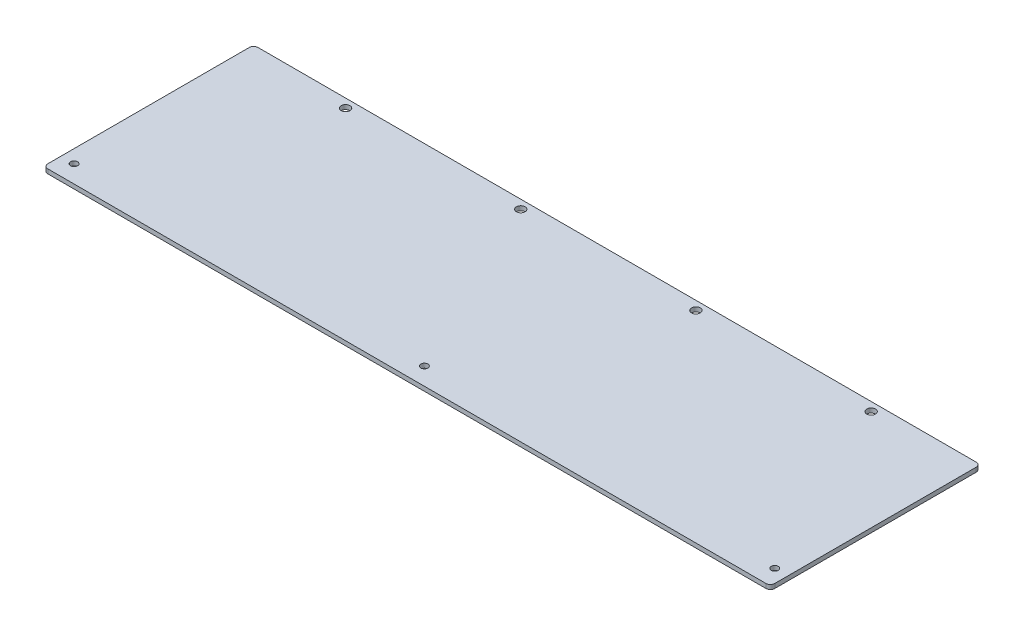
ISO-10303-21;
HEADER;
FILE_DESCRIPTION(('STEP AP214'),'2;1');
FILE_NAME('part.step','',(''),(''),'','','');
FILE_SCHEMA(('AUTOMOTIVE_DESIGN { 1 0 10303 214 1 1 1 1 }'));
ENDSEC;
DATA;
#1=APPLICATION_CONTEXT('core data for automotive mechanical design processes');
#2=APPLICATION_PROTOCOL_DEFINITION('international standard','automotive_design',2000,#1);
#3=PRODUCT_CONTEXT('',#1,'mechanical');
#4=PRODUCT('Part','Part','',(#3));
#5=PRODUCT_RELATED_PRODUCT_CATEGORY('part','',(#4));
#6=PRODUCT_DEFINITION_FORMATION('','',#4);
#7=PRODUCT_DEFINITION_CONTEXT('part definition',#1,'design');
#8=PRODUCT_DEFINITION('design','',#6,#7);
#9=PRODUCT_DEFINITION_SHAPE('','',#8);
#10=(LENGTH_UNIT() NAMED_UNIT(*) SI_UNIT(.MILLI.,.METRE.));
#11=(NAMED_UNIT(*) PLANE_ANGLE_UNIT() SI_UNIT($,.RADIAN.));
#12=(NAMED_UNIT(*) SI_UNIT($,.STERADIAN.) SOLID_ANGLE_UNIT());
#13=UNCERTAINTY_MEASURE_WITH_UNIT(LENGTH_MEASURE(1.E-05),#10,'distance_accuracy_value','');
#14=(GEOMETRIC_REPRESENTATION_CONTEXT(3) GLOBAL_UNCERTAINTY_ASSIGNED_CONTEXT((#13)) GLOBAL_UNIT_ASSIGNED_CONTEXT((#10,
#11,#12)) REPRESENTATION_CONTEXT('',''));
#15=CARTESIAN_POINT('',(0.,0.,0.));
#16=DIRECTION('',(0.,0.,1.));
#17=DIRECTION('',(1.,0.,0.));
#18=AXIS2_PLACEMENT_3D('',#15,#16,#17);
#19=CARTESIAN_POINT('',(263.525,3.175,-76.2));
#20=DIRECTION('',(-1.,0.,0.));
#21=DIRECTION('',(0.,0.,1.));
#22=AXIS2_PLACEMENT_3D('',#19,#20,#21);
#23=PLANE('',#22);
#24=DIRECTION('',(0.,0.,-1.));
#25=VECTOR('',#24,1.);
#26=CARTESIAN_POINT('',(263.525,3.175,-76.2));
#27=LINE('',#26,#25);
#28=CARTESIAN_POINT('',(263.525,3.175,73.025));
#29=VERTEX_POINT('',#28);
#30=CARTESIAN_POINT('',(263.525,3.175,-73.025));
#31=VERTEX_POINT('',#30);
#32=EDGE_CURVE('E134',#29,#31,#27,.T.);
#33=ORIENTED_EDGE('',*,*,#32,.F.);
#34=DIRECTION('',(0.,-1.,0.));
#35=VECTOR('',#34,1.);
#36=CARTESIAN_POINT('',(263.525,3.175,73.025));
#37=LINE('',#36,#35);
#38=CARTESIAN_POINT('',(263.525,0.,73.025));
#39=VERTEX_POINT('',#38);
#40=EDGE_CURVE('E11',#29,#39,#37,.T.);
#41=ORIENTED_EDGE('',*,*,#40,.T.);
#42=DIRECTION('',(0.,0.,-1.));
#43=VECTOR('',#42,1.);
#44=CARTESIAN_POINT('',(263.525,0.,-76.2));
#45=LINE('',#44,#43);
#46=CARTESIAN_POINT('',(263.525,0.,-73.025));
#47=VERTEX_POINT('',#46);
#48=EDGE_CURVE('E182',#39,#47,#45,.T.);
#49=ORIENTED_EDGE('',*,*,#48,.T.);
#50=DIRECTION('',(0.,-1.,0.));
#51=VECTOR('',#50,1.);
#52=CARTESIAN_POINT('',(263.525,3.175,-73.025));
#53=LINE('',#52,#51);
#54=EDGE_CURVE('E45',#47,#31,#53,.F.);
#55=ORIENTED_EDGE('',*,*,#54,.T.);
#56=EDGE_LOOP('',(#33,#41,#49,#55));
#57=FACE_BOUND('',#56,.T.);
#58=ADVANCED_FACE('F36',(#57),#23,.F.);
#59=CARTESIAN_POINT('',(-263.525,3.175,-76.2));
#60=DIRECTION('',(0.,0.,1.));
#61=DIRECTION('',(1.,0.,0.));
#62=AXIS2_PLACEMENT_3D('',#59,#60,#61);
#63=PLANE('',#62);
#64=DIRECTION('',(-1.,0.,0.));
#65=VECTOR('',#64,1.);
#66=CARTESIAN_POINT('',(-263.525,0.,-76.2));
#67=LINE('',#66,#65);
#68=CARTESIAN_POINT('',(260.35,0.,-76.2));
#69=VERTEX_POINT('',#68);
#70=CARTESIAN_POINT('',(-260.35,0.,-76.2));
#71=VERTEX_POINT('',#70);
#72=EDGE_CURVE('E142',#69,#71,#67,.T.);
#73=ORIENTED_EDGE('',*,*,#72,.T.);
#74=DIRECTION('',(0.,-1.,0.));
#75=VECTOR('',#74,1.);
#76=CARTESIAN_POINT('',(-260.35,3.175,-76.2));
#77=LINE('',#76,#75);
#78=CARTESIAN_POINT('',(-260.35,3.175,-76.2));
#79=VERTEX_POINT('',#78);
#80=EDGE_CURVE('E52',#71,#79,#77,.F.);
#81=ORIENTED_EDGE('',*,*,#80,.T.);
#82=DIRECTION('',(-1.,0.,0.));
#83=VECTOR('',#82,1.);
#84=CARTESIAN_POINT('',(-263.525,3.175,-76.2));
#85=LINE('',#84,#83);
#86=CARTESIAN_POINT('',(260.35,3.175,-76.2));
#87=VERTEX_POINT('',#86);
#88=EDGE_CURVE('E140',#87,#79,#85,.T.);
#89=ORIENTED_EDGE('',*,*,#88,.F.);
#90=DIRECTION('',(0.,-1.,0.));
#91=VECTOR('',#90,1.);
#92=CARTESIAN_POINT('',(260.35,3.175,-76.2));
#93=LINE('',#92,#91);
#94=EDGE_CURVE('E170',#87,#69,#93,.T.);
#95=ORIENTED_EDGE('',*,*,#94,.T.);
#96=EDGE_LOOP('',(#73,#81,#89,#95));
#97=FACE_BOUND('',#96,.T.);
#98=ADVANCED_FACE('F189',(#97),#63,.F.);
#99=CARTESIAN_POINT('',(-263.525,3.175,-76.2));
#100=DIRECTION('',(1.,0.,0.));
#101=DIRECTION('',(0.,0.,-1.));
#102=AXIS2_PLACEMENT_3D('',#99,#100,#101);
#103=PLANE('',#102);
#104=DIRECTION('',(0.,0.,1.));
#105=VECTOR('',#104,1.);
#106=CARTESIAN_POINT('',(-263.525,0.,-76.2));
#107=LINE('',#106,#105);
#108=CARTESIAN_POINT('',(-263.525,0.,-73.025));
#109=VERTEX_POINT('',#108);
#110=CARTESIAN_POINT('',(-263.525,0.,73.025));
#111=VERTEX_POINT('',#110);
#112=EDGE_CURVE('E135',#109,#111,#107,.T.);
#113=ORIENTED_EDGE('',*,*,#112,.T.);
#114=DIRECTION('',(0.,-1.,0.));
#115=VECTOR('',#114,1.);
#116=CARTESIAN_POINT('',(-263.525,3.175,73.025));
#117=LINE('',#116,#115);
#118=CARTESIAN_POINT('',(-263.525,3.175,73.025));
#119=VERTEX_POINT('',#118);
#120=EDGE_CURVE('E109',#111,#119,#117,.F.);
#121=ORIENTED_EDGE('',*,*,#120,.T.);
#122=DIRECTION('',(0.,0.,1.));
#123=VECTOR('',#122,1.);
#124=CARTESIAN_POINT('',(-263.525,3.175,-76.2));
#125=LINE('',#124,#123);
#126=CARTESIAN_POINT('',(-263.525,3.175,-73.025));
#127=VERTEX_POINT('',#126);
#128=EDGE_CURVE('E198',#127,#119,#125,.T.);
#129=ORIENTED_EDGE('',*,*,#128,.F.);
#130=DIRECTION('',(0.,-1.,0.));
#131=VECTOR('',#130,1.);
#132=CARTESIAN_POINT('',(-263.525,3.175,-73.025));
#133=LINE('',#132,#131);
#134=EDGE_CURVE('E115',#127,#109,#133,.T.);
#135=ORIENTED_EDGE('',*,*,#134,.T.);
#136=EDGE_LOOP('',(#113,#121,#129,#135));
#137=FACE_BOUND('',#136,.T.);
#138=ADVANCED_FACE('F296',(#137),#103,.F.);
#139=CARTESIAN_POINT('',(-263.525,3.175,76.2));
#140=DIRECTION('',(0.,0.,-1.));
#141=DIRECTION('',(-1.,0.,0.));
#142=AXIS2_PLACEMENT_3D('',#139,#140,#141);
#143=PLANE('',#142);
#144=DIRECTION('',(1.,0.,0.));
#145=VECTOR('',#144,1.);
#146=CARTESIAN_POINT('',(-263.525,3.175,76.2));
#147=LINE('',#146,#145);
#148=CARTESIAN_POINT('',(-260.35,3.175,76.2));
#149=VERTEX_POINT('',#148);
#150=CARTESIAN_POINT('',(260.35,3.175,76.2));
#151=VERTEX_POINT('',#150);
#152=EDGE_CURVE('E125',#149,#151,#147,.T.);
#153=ORIENTED_EDGE('',*,*,#152,.F.);
#154=DIRECTION('',(0.,-1.,0.));
#155=VECTOR('',#154,1.);
#156=CARTESIAN_POINT('',(-260.35,3.175,76.2));
#157=LINE('',#156,#155);
#158=CARTESIAN_POINT('',(-260.35,0.,76.2));
#159=VERTEX_POINT('',#158);
#160=EDGE_CURVE('E108',#149,#159,#157,.T.);
#161=ORIENTED_EDGE('',*,*,#160,.T.);
#162=DIRECTION('',(1.,0.,0.));
#163=VECTOR('',#162,1.);
#164=CARTESIAN_POINT('',(-263.525,0.,76.2));
#165=LINE('',#164,#163);
#166=CARTESIAN_POINT('',(260.35,0.,76.2));
#167=VERTEX_POINT('',#166);
#168=EDGE_CURVE('E122',#159,#167,#165,.T.);
#169=ORIENTED_EDGE('',*,*,#168,.T.);
#170=DIRECTION('',(0.,-1.,0.));
#171=VECTOR('',#170,1.);
#172=CARTESIAN_POINT('',(260.35,3.175,76.2));
#173=LINE('',#172,#171);
#174=EDGE_CURVE('E128',#167,#151,#173,.F.);
#175=ORIENTED_EDGE('',*,*,#174,.T.);
#176=EDGE_LOOP('',(#153,#161,#169,#175));
#177=FACE_BOUND('',#176,.T.);
#178=ADVANCED_FACE('F121',(#177),#143,.F.);
#179=CARTESIAN_POINT('',(0.,3.175,0.));
#180=DIRECTION('',(0.,1.,0.));
#181=DIRECTION('',(0.,0.,1.));
#182=AXIS2_PLACEMENT_3D('',#179,#180,#181);
#183=PLANE('',#182);
#184=CARTESIAN_POINT('',(190.5,3.175,-69.85));
#185=DIRECTION('',(0.,1.,0.));
#186=DIRECTION('',(0.,0.,1.));
#187=AXIS2_PLACEMENT_3D('',#184,#185,#186);
#188=CIRCLE('',#187,3.17500000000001);
#189=CARTESIAN_POINT('',(190.5,3.175,-66.675));
#190=VERTEX_POINT('',#189);
#191=EDGE_CURVE('E254',#190,#190,#188,.T.);
#192=ORIENTED_EDGE('',*,*,#191,.F.);
#193=EDGE_LOOP('',(#192));
#194=FACE_BOUND('',#193,.T.);
#195=CARTESIAN_POINT('',(63.5,3.175,-69.85));
#196=DIRECTION('',(0.,1.,0.));
#197=DIRECTION('',(0.,0.,1.));
#198=AXIS2_PLACEMENT_3D('',#195,#196,#197);
#199=CIRCLE('',#198,3.175);
#200=CARTESIAN_POINT('',(63.5,3.175,-66.675));
#201=VERTEX_POINT('',#200);
#202=EDGE_CURVE('E246',#201,#201,#199,.T.);
#203=ORIENTED_EDGE('',*,*,#202,.F.);
#204=EDGE_LOOP('',(#203));
#205=FACE_BOUND('',#204,.T.);
#206=CARTESIAN_POINT('',(-63.5,3.175,-69.85));
#207=DIRECTION('',(0.,1.,0.));
#208=DIRECTION('',(0.,0.,1.));
#209=AXIS2_PLACEMENT_3D('',#206,#207,#208);
#210=CIRCLE('',#209,3.175);
#211=CARTESIAN_POINT('',(-63.5,3.175,-66.675));
#212=VERTEX_POINT('',#211);
#213=EDGE_CURVE('E238',#212,#212,#210,.T.);
#214=ORIENTED_EDGE('',*,*,#213,.F.);
#215=EDGE_LOOP('',(#214));
#216=FACE_BOUND('',#215,.T.);
#217=CARTESIAN_POINT('',(-190.5,3.175,-69.85));
#218=DIRECTION('',(0.,1.,0.));
#219=DIRECTION('',(0.,0.,1.));
#220=AXIS2_PLACEMENT_3D('',#217,#218,#219);
#221=CIRCLE('',#220,3.17500000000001);
#222=CARTESIAN_POINT('',(-190.5,3.175,-66.675));
#223=VERTEX_POINT('',#222);
#224=EDGE_CURVE('E230',#223,#223,#221,.T.);
#225=ORIENTED_EDGE('',*,*,#224,.F.);
#226=EDGE_LOOP('',(#225));
#227=FACE_BOUND('',#226,.T.);
#228=CARTESIAN_POINT('',(254.,3.175,63.5));
#229=DIRECTION('',(0.,-1.,0.));
#230=DIRECTION('',(0.,0.,-1.));
#231=AXIS2_PLACEMENT_3D('',#228,#229,#230);
#232=CIRCLE('',#231,2.55270000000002);
#233=CARTESIAN_POINT('',(254.,3.175,60.9473));
#234=VERTEX_POINT('',#233);
#235=EDGE_CURVE('E218',#234,#234,#232,.T.);
#236=ORIENTED_EDGE('',*,*,#235,.T.);
#237=EDGE_LOOP('',(#236));
#238=FACE_BOUND('',#237,.T.);
#239=CARTESIAN_POINT('',(0.,3.175,63.5));
#240=DIRECTION('',(0.,-1.,0.));
#241=DIRECTION('',(0.,0.,-1.));
#242=AXIS2_PLACEMENT_3D('',#239,#240,#241);
#243=CIRCLE('',#242,2.5527);
#244=CARTESIAN_POINT('',(0.,3.175,60.9473));
#245=VERTEX_POINT('',#244);
#246=EDGE_CURVE('E210',#245,#245,#243,.T.);
#247=ORIENTED_EDGE('',*,*,#246,.T.);
#248=EDGE_LOOP('',(#247));
#249=FACE_BOUND('',#248,.T.);
#250=CARTESIAN_POINT('',(-254.,3.175,63.5));
#251=DIRECTION('',(0.,-1.,0.));
#252=DIRECTION('',(0.,0.,-1.));
#253=AXIS2_PLACEMENT_3D('',#250,#251,#252);
#254=CIRCLE('',#253,2.55270000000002);
#255=CARTESIAN_POINT('',(-254.,3.175,60.9473));
#256=VERTEX_POINT('',#255);
#257=EDGE_CURVE('E193',#256,#256,#254,.T.);
#258=ORIENTED_EDGE('',*,*,#257,.T.);
#259=EDGE_LOOP('',(#258));
#260=FACE_BOUND('',#259,.T.);
#261=ORIENTED_EDGE('',*,*,#128,.T.);
#262=CARTESIAN_POINT('',(-260.35,3.175,73.025));
#263=DIRECTION('',(0.,1.,0.));
#264=DIRECTION('',(0.,0.,1.));
#265=AXIS2_PLACEMENT_3D('',#262,#263,#264);
#266=CIRCLE('',#265,3.175);
#267=EDGE_CURVE('E167',#119,#149,#266,.T.);
#268=ORIENTED_EDGE('',*,*,#267,.T.);
#269=ORIENTED_EDGE('',*,*,#152,.T.);
#270=CARTESIAN_POINT('',(260.35,3.175,73.025));
#271=DIRECTION('',(0.,1.,0.));
#272=DIRECTION('',(0.,0.,1.));
#273=AXIS2_PLACEMENT_3D('',#270,#271,#272);
#274=CIRCLE('',#273,3.175);
#275=EDGE_CURVE('E161',#151,#29,#274,.T.);
#276=ORIENTED_EDGE('',*,*,#275,.T.);
#277=ORIENTED_EDGE('',*,*,#32,.T.);
#278=CARTESIAN_POINT('',(260.35,3.175,-73.025));
#279=DIRECTION('',(0.,1.,0.));
#280=DIRECTION('',(0.,0.,1.));
#281=AXIS2_PLACEMENT_3D('',#278,#279,#280);
#282=CIRCLE('',#281,3.175);
#283=EDGE_CURVE('E59',#31,#87,#282,.T.);
#284=ORIENTED_EDGE('',*,*,#283,.T.);
#285=ORIENTED_EDGE('',*,*,#88,.T.);
#286=CARTESIAN_POINT('',(-260.35,3.175,-73.025));
#287=DIRECTION('',(0.,1.,0.));
#288=DIRECTION('',(0.,0.,1.));
#289=AXIS2_PLACEMENT_3D('',#286,#287,#288);
#290=CIRCLE('',#289,3.175);
#291=EDGE_CURVE('E164',#79,#127,#290,.T.);
#292=ORIENTED_EDGE('',*,*,#291,.T.);
#293=EDGE_LOOP('',(#261,#268,#269,#276,#277,#284,#285,#292));
#294=FACE_BOUND('',#293,.T.);
#295=ADVANCED_FACE('F185',(#194,#205,#216,#227,#238,#249,#260,#294),#183,.T.);
#296=CARTESIAN_POINT('',(0.,0.,0.));
#297=DIRECTION('',(0.,1.,0.));
#298=DIRECTION('',(0.,0.,1.));
#299=AXIS2_PLACEMENT_3D('',#296,#297,#298);
#300=PLANE('',#299);
#301=CARTESIAN_POINT('',(190.5,0.,-69.85));
#302=DIRECTION('',(0.,1.,0.));
#303=DIRECTION('',(0.,0.,1.));
#304=AXIS2_PLACEMENT_3D('',#301,#302,#303);
#305=CIRCLE('',#304,3.17500000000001);
#306=CARTESIAN_POINT('',(190.5,0.,-66.675));
#307=VERTEX_POINT('',#306);
#308=EDGE_CURVE('E250',#307,#307,#305,.T.);
#309=ORIENTED_EDGE('',*,*,#308,.T.);
#310=EDGE_LOOP('',(#309));
#311=FACE_BOUND('',#310,.T.);
#312=CARTESIAN_POINT('',(63.5,0.,-69.85));
#313=DIRECTION('',(0.,1.,0.));
#314=DIRECTION('',(0.,0.,1.));
#315=AXIS2_PLACEMENT_3D('',#312,#313,#314);
#316=CIRCLE('',#315,3.175);
#317=CARTESIAN_POINT('',(63.5,0.,-66.675));
#318=VERTEX_POINT('',#317);
#319=EDGE_CURVE('E242',#318,#318,#316,.T.);
#320=ORIENTED_EDGE('',*,*,#319,.T.);
#321=EDGE_LOOP('',(#320));
#322=FACE_BOUND('',#321,.T.);
#323=CARTESIAN_POINT('',(-63.5,0.,-69.85));
#324=DIRECTION('',(0.,1.,0.));
#325=DIRECTION('',(0.,0.,1.));
#326=AXIS2_PLACEMENT_3D('',#323,#324,#325);
#327=CIRCLE('',#326,3.175);
#328=CARTESIAN_POINT('',(-63.5,0.,-66.675));
#329=VERTEX_POINT('',#328);
#330=EDGE_CURVE('E234',#329,#329,#327,.T.);
#331=ORIENTED_EDGE('',*,*,#330,.T.);
#332=EDGE_LOOP('',(#331));
#333=FACE_BOUND('',#332,.T.);
#334=CARTESIAN_POINT('',(-190.5,0.,-69.85));
#335=DIRECTION('',(0.,1.,0.));
#336=DIRECTION('',(0.,0.,1.));
#337=AXIS2_PLACEMENT_3D('',#334,#335,#336);
#338=CIRCLE('',#337,3.17500000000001);
#339=CARTESIAN_POINT('',(-190.5,0.,-66.675));
#340=VERTEX_POINT('',#339);
#341=EDGE_CURVE('E226',#340,#340,#338,.T.);
#342=ORIENTED_EDGE('',*,*,#341,.T.);
#343=EDGE_LOOP('',(#342));
#344=FACE_BOUND('',#343,.T.);
#345=CARTESIAN_POINT('',(254.,0.,63.5));
#346=DIRECTION('',(0.,-1.,0.));
#347=DIRECTION('',(0.,0.,-1.));
#348=AXIS2_PLACEMENT_3D('',#345,#346,#347);
#349=CIRCLE('',#348,2.55269999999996);
#350=CARTESIAN_POINT('',(254.,0.,60.9473));
#351=VERTEX_POINT('',#350);
#352=EDGE_CURVE('E222',#351,#351,#349,.T.);
#353=ORIENTED_EDGE('',*,*,#352,.F.);
#354=EDGE_LOOP('',(#353));
#355=FACE_BOUND('',#354,.T.);
#356=CARTESIAN_POINT('',(0.,0.,63.5));
#357=DIRECTION('',(0.,-1.,0.));
#358=DIRECTION('',(0.,0.,-1.));
#359=AXIS2_PLACEMENT_3D('',#356,#357,#358);
#360=CIRCLE('',#359,2.55269999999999);
#361=CARTESIAN_POINT('',(0.,0.,60.9473));
#362=VERTEX_POINT('',#361);
#363=EDGE_CURVE('E214',#362,#362,#360,.T.);
#364=ORIENTED_EDGE('',*,*,#363,.F.);
#365=EDGE_LOOP('',(#364));
#366=FACE_BOUND('',#365,.T.);
#367=CARTESIAN_POINT('',(-254.,0.,63.5));
#368=DIRECTION('',(0.,-1.,0.));
#369=DIRECTION('',(0.,0.,-1.));
#370=AXIS2_PLACEMENT_3D('',#367,#368,#369);
#371=CIRCLE('',#370,2.55269999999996);
#372=CARTESIAN_POINT('',(-254.,0.,60.9473));
#373=VERTEX_POINT('',#372);
#374=EDGE_CURVE('E206',#373,#373,#371,.T.);
#375=ORIENTED_EDGE('',*,*,#374,.F.);
#376=EDGE_LOOP('',(#375));
#377=FACE_BOUND('',#376,.T.);
#378=ORIENTED_EDGE('',*,*,#168,.F.);
#379=CARTESIAN_POINT('',(-260.35,0.,73.025));
#380=DIRECTION('',(0.,1.,0.));
#381=DIRECTION('',(0.,0.,1.));
#382=AXIS2_PLACEMENT_3D('',#379,#380,#381);
#383=CIRCLE('',#382,3.175);
#384=EDGE_CURVE('E104',#159,#111,#383,.F.);
#385=ORIENTED_EDGE('',*,*,#384,.T.);
#386=ORIENTED_EDGE('',*,*,#112,.F.);
#387=CARTESIAN_POINT('',(-260.35,0.,-73.025));
#388=DIRECTION('',(0.,1.,0.));
#389=DIRECTION('',(0.,0.,1.));
#390=AXIS2_PLACEMENT_3D('',#387,#388,#389);
#391=CIRCLE('',#390,3.175);
#392=EDGE_CURVE('E116',#109,#71,#391,.F.);
#393=ORIENTED_EDGE('',*,*,#392,.T.);
#394=ORIENTED_EDGE('',*,*,#72,.F.);
#395=CARTESIAN_POINT('',(260.35,0.,-73.025));
#396=DIRECTION('',(0.,1.,0.));
#397=DIRECTION('',(0.,0.,1.));
#398=AXIS2_PLACEMENT_3D('',#395,#396,#397);
#399=CIRCLE('',#398,3.175);
#400=EDGE_CURVE('E127',#69,#47,#399,.F.);
#401=ORIENTED_EDGE('',*,*,#400,.T.);
#402=ORIENTED_EDGE('',*,*,#48,.F.);
#403=CARTESIAN_POINT('',(260.35,0.,73.025));
#404=DIRECTION('',(0.,1.,0.));
#405=DIRECTION('',(0.,0.,1.));
#406=AXIS2_PLACEMENT_3D('',#403,#404,#405);
#407=CIRCLE('',#406,3.175);
#408=EDGE_CURVE('E132',#39,#167,#407,.F.);
#409=ORIENTED_EDGE('',*,*,#408,.T.);
#410=EDGE_LOOP('',(#378,#385,#386,#393,#394,#401,#402,#409));
#411=FACE_BOUND('',#410,.T.);
#412=ADVANCED_FACE('F130',(#311,#322,#333,#344,#355,#366,#377,#411),#300,.F.);
#413=CARTESIAN_POINT('',(-254.,0.,63.5));
#414=DIRECTION('',(0.,-1.,0.));
#415=DIRECTION('',(0.,0.,-1.));
#416=AXIS2_PLACEMENT_3D('',#413,#414,#415);
#417=CYLINDRICAL_SURFACE('',#416,2.55269999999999);
#418=ORIENTED_EDGE('',*,*,#257,.F.);
#419=EDGE_LOOP('',(#418));
#420=FACE_BOUND('',#419,.T.);
#421=ORIENTED_EDGE('',*,*,#374,.T.);
#422=EDGE_LOOP('',(#421));
#423=FACE_BOUND('',#422,.T.);
#424=ADVANCED_FACE('F277',(#420,#423),#417,.F.);
#425=CARTESIAN_POINT('',(0.,0.,63.5));
#426=DIRECTION('',(0.,-1.,0.));
#427=DIRECTION('',(0.,0.,-1.));
#428=AXIS2_PLACEMENT_3D('',#425,#426,#427);
#429=CYLINDRICAL_SURFACE('',#428,2.55269999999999);
#430=ORIENTED_EDGE('',*,*,#246,.F.);
#431=EDGE_LOOP('',(#430));
#432=FACE_BOUND('',#431,.T.);
#433=ORIENTED_EDGE('',*,*,#363,.T.);
#434=EDGE_LOOP('',(#433));
#435=FACE_BOUND('',#434,.T.);
#436=ADVANCED_FACE('F280',(#432,#435),#429,.F.);
#437=CARTESIAN_POINT('',(254.,0.,63.5));
#438=DIRECTION('',(0.,-1.,0.));
#439=DIRECTION('',(0.,0.,-1.));
#440=AXIS2_PLACEMENT_3D('',#437,#438,#439);
#441=CYLINDRICAL_SURFACE('',#440,2.55269999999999);
#442=ORIENTED_EDGE('',*,*,#235,.F.);
#443=EDGE_LOOP('',(#442));
#444=FACE_BOUND('',#443,.T.);
#445=ORIENTED_EDGE('',*,*,#352,.T.);
#446=EDGE_LOOP('',(#445));
#447=FACE_BOUND('',#446,.T.);
#448=ADVANCED_FACE('F303',(#444,#447),#441,.F.);
#449=CARTESIAN_POINT('',(-260.35,3.175,73.025));
#450=DIRECTION('',(0.,-1.,0.));
#451=DIRECTION('',(0.,0.,-1.));
#452=AXIS2_PLACEMENT_3D('',#449,#450,#451);
#453=CYLINDRICAL_SURFACE('',#452,3.175);
#454=ORIENTED_EDGE('',*,*,#267,.F.);
#455=ORIENTED_EDGE('',*,*,#120,.F.);
#456=ORIENTED_EDGE('',*,*,#384,.F.);
#457=ORIENTED_EDGE('',*,*,#160,.F.);
#458=EDGE_LOOP('',(#454,#455,#456,#457));
#459=FACE_BOUND('',#458,.T.);
#460=ADVANCED_FACE('F107',(#459),#453,.T.);
#461=CARTESIAN_POINT('',(-260.35,3.175,-73.025));
#462=DIRECTION('',(0.,-1.,0.));
#463=DIRECTION('',(0.,0.,-1.));
#464=AXIS2_PLACEMENT_3D('',#461,#462,#463);
#465=CYLINDRICAL_SURFACE('',#464,3.175);
#466=ORIENTED_EDGE('',*,*,#291,.F.);
#467=ORIENTED_EDGE('',*,*,#80,.F.);
#468=ORIENTED_EDGE('',*,*,#392,.F.);
#469=ORIENTED_EDGE('',*,*,#134,.F.);
#470=EDGE_LOOP('',(#466,#467,#468,#469));
#471=FACE_BOUND('',#470,.T.);
#472=ADVANCED_FACE('F302',(#471),#465,.T.);
#473=CARTESIAN_POINT('',(260.35,3.175,73.025));
#474=DIRECTION('',(0.,-1.,0.));
#475=DIRECTION('',(0.,0.,-1.));
#476=AXIS2_PLACEMENT_3D('',#473,#474,#475);
#477=CYLINDRICAL_SURFACE('',#476,3.175);
#478=ORIENTED_EDGE('',*,*,#275,.F.);
#479=ORIENTED_EDGE('',*,*,#174,.F.);
#480=ORIENTED_EDGE('',*,*,#408,.F.);
#481=ORIENTED_EDGE('',*,*,#40,.F.);
#482=EDGE_LOOP('',(#478,#479,#480,#481));
#483=FACE_BOUND('',#482,.T.);
#484=ADVANCED_FACE('F305',(#483),#477,.T.);
#485=CARTESIAN_POINT('',(260.35,3.175,-73.025));
#486=DIRECTION('',(0.,-1.,0.));
#487=DIRECTION('',(0.,0.,-1.));
#488=AXIS2_PLACEMENT_3D('',#485,#486,#487);
#489=CYLINDRICAL_SURFACE('',#488,3.175);
#490=ORIENTED_EDGE('',*,*,#283,.F.);
#491=ORIENTED_EDGE('',*,*,#54,.F.);
#492=ORIENTED_EDGE('',*,*,#400,.F.);
#493=ORIENTED_EDGE('',*,*,#94,.F.);
#494=EDGE_LOOP('',(#490,#491,#492,#493));
#495=FACE_BOUND('',#494,.T.);
#496=ADVANCED_FACE('F38',(#495),#489,.T.);
#497=CARTESIAN_POINT('',(-190.5,3.175,-69.85));
#498=DIRECTION('',(0.,1.,0.));
#499=DIRECTION('',(0.,0.,1.));
#500=AXIS2_PLACEMENT_3D('',#497,#498,#499);
#501=CYLINDRICAL_SURFACE('',#500,3.17500000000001);
#502=ORIENTED_EDGE('',*,*,#341,.F.);
#503=EDGE_LOOP('',(#502));
#504=FACE_BOUND('',#503,.T.);
#505=ORIENTED_EDGE('',*,*,#224,.T.);
#506=EDGE_LOOP('',(#505));
#507=FACE_BOUND('',#506,.T.);
#508=ADVANCED_FACE('F312',(#504,#507),#501,.F.);
#509=CARTESIAN_POINT('',(-63.5,3.175,-69.85));
#510=DIRECTION('',(0.,1.,0.));
#511=DIRECTION('',(0.,0.,1.));
#512=AXIS2_PLACEMENT_3D('',#509,#510,#511);
#513=CYLINDRICAL_SURFACE('',#512,3.175);
#514=ORIENTED_EDGE('',*,*,#330,.F.);
#515=EDGE_LOOP('',(#514));
#516=FACE_BOUND('',#515,.T.);
#517=ORIENTED_EDGE('',*,*,#213,.T.);
#518=EDGE_LOOP('',(#517));
#519=FACE_BOUND('',#518,.T.);
#520=ADVANCED_FACE('F387',(#516,#519),#513,.F.);
#521=CARTESIAN_POINT('',(63.5,3.175,-69.85));
#522=DIRECTION('',(0.,1.,0.));
#523=DIRECTION('',(0.,0.,1.));
#524=AXIS2_PLACEMENT_3D('',#521,#522,#523);
#525=CYLINDRICAL_SURFACE('',#524,3.175);
#526=ORIENTED_EDGE('',*,*,#319,.F.);
#527=EDGE_LOOP('',(#526));
#528=FACE_BOUND('',#527,.T.);
#529=ORIENTED_EDGE('',*,*,#202,.T.);
#530=EDGE_LOOP('',(#529));
#531=FACE_BOUND('',#530,.T.);
#532=ADVANCED_FACE('F397',(#528,#531),#525,.F.);
#533=CARTESIAN_POINT('',(190.5,3.175,-69.85));
#534=DIRECTION('',(0.,1.,0.));
#535=DIRECTION('',(0.,0.,1.));
#536=AXIS2_PLACEMENT_3D('',#533,#534,#535);
#537=CYLINDRICAL_SURFACE('',#536,3.17500000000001);
#538=ORIENTED_EDGE('',*,*,#308,.F.);
#539=EDGE_LOOP('',(#538));
#540=FACE_BOUND('',#539,.T.);
#541=ORIENTED_EDGE('',*,*,#191,.T.);
#542=EDGE_LOOP('',(#541));
#543=FACE_BOUND('',#542,.T.);
#544=ADVANCED_FACE('F260',(#540,#543),#537,.F.);
#545=CLOSED_SHELL('',(#58,#98,#138,#178,#295,#412,#424,#436,#448,#460,#472,#484,#496,#508,#520,
#532,#544));
#546=MANIFOLD_SOLID_BREP('B2',#545);
#547=ADVANCED_BREP_SHAPE_REPRESENTATION('',(#18,#546),#14);
#548=SHAPE_DEFINITION_REPRESENTATION(#9,#547);
ENDSEC;
END-ISO-10303-21;
